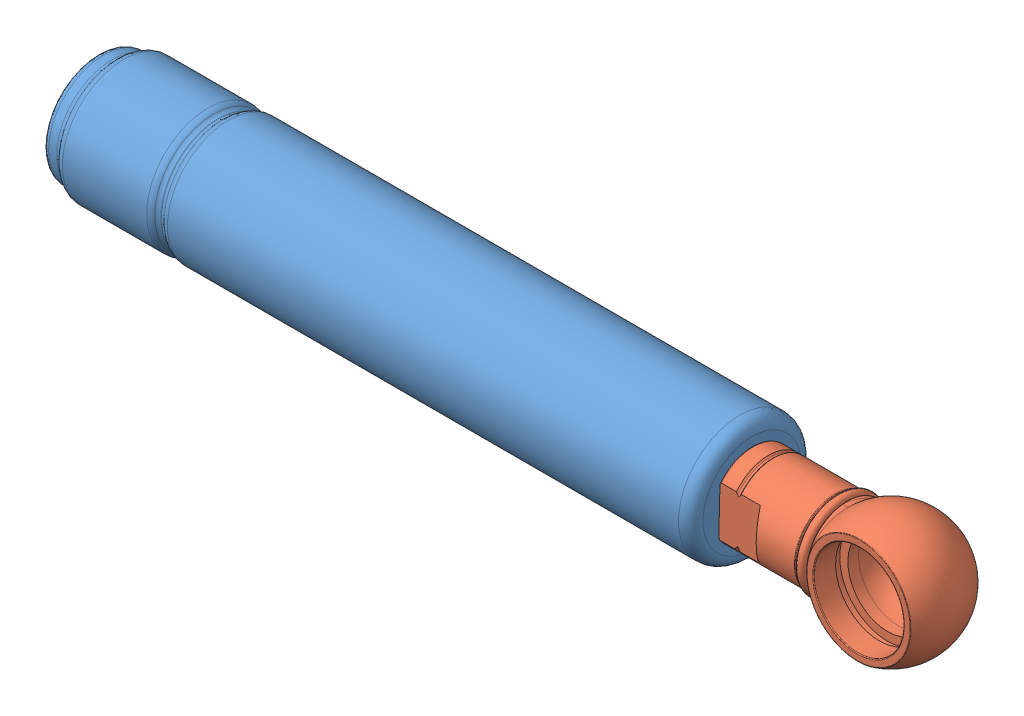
SolidWorks assembly corps ressort assemble.SLDASM, configuration Défaut (file format 6000). Lengths in mm.
Overall size (105.47 15.31 15).
2 component instances, 2 part files, 2 mates.
Components (placement in the parent):
- corps ressort-1: corps ressort.SLDPRT [Défaut] at (-35.3009 2.4494 79.9742) size (79.97 15 15)
- STD-rotule femelle-1: STD-rotule femelle.SLDPRT [Défaut] at (56.0744 2.4494 79.9742) x (-1 0 0) z (0 -0.99965 0.026469) size (25.53 11.8 15)
Mates (geometry in assembly coordinates):
- Coaxiale1: concentric aligned: cylinder of corps ressort-1 through (44.1733 2.4494 79.9742) axis (1 0 0) radius 7.5; cylinder of STD-rotule femelle-1 through (62.1733 2.4494 79.9742) axis (1 0 0) radius 5
- Coïncidente1: coincident anti-aligned: plane of corps ressort-1 through (44.1733 2.4494 79.9742) normal (1 0 0); plane of STD-rotule femelle-1 through (44.1733 2.3567 76.4755) normal (-1 0 0)
